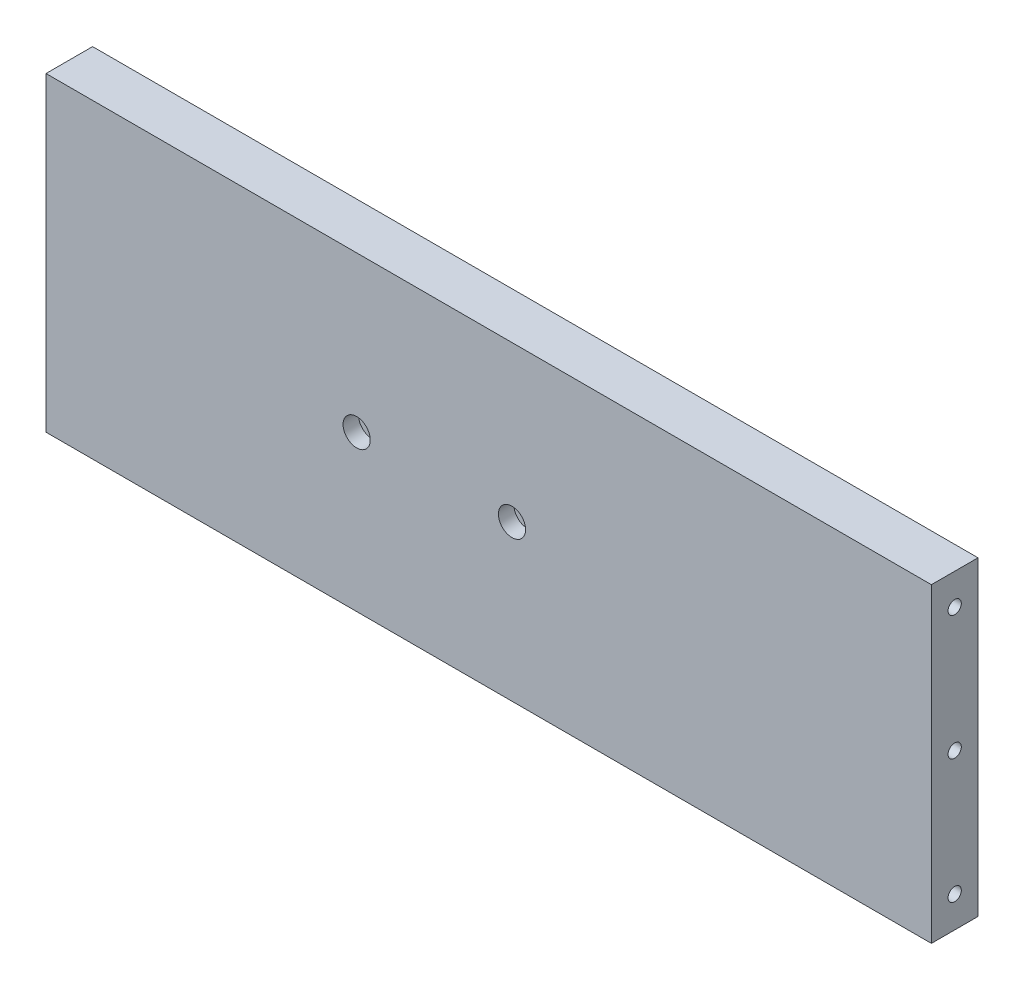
ISO-10303-21;
HEADER;
FILE_DESCRIPTION(('STEP AP214'),'2;1');
FILE_NAME('part.step','',(''),(''),'','','');
FILE_SCHEMA(('AUTOMOTIVE_DESIGN { 1 0 10303 214 1 1 1 1 }'));
ENDSEC;
DATA;
#1=APPLICATION_CONTEXT('core data for automotive mechanical design processes');
#2=APPLICATION_PROTOCOL_DEFINITION('international standard','automotive_design',2000,#1);
#3=PRODUCT_CONTEXT('',#1,'mechanical');
#4=PRODUCT('Part','Part','',(#3));
#5=PRODUCT_RELATED_PRODUCT_CATEGORY('part','',(#4));
#6=PRODUCT_DEFINITION_FORMATION('','',#4);
#7=PRODUCT_DEFINITION_CONTEXT('part definition',#1,'design');
#8=PRODUCT_DEFINITION('design','',#6,#7);
#9=PRODUCT_DEFINITION_SHAPE('','',#8);
#10=(LENGTH_UNIT() NAMED_UNIT(*) SI_UNIT(.MILLI.,.METRE.));
#11=(NAMED_UNIT(*) PLANE_ANGLE_UNIT() SI_UNIT($,.RADIAN.));
#12=(NAMED_UNIT(*) SI_UNIT($,.STERADIAN.) SOLID_ANGLE_UNIT());
#13=UNCERTAINTY_MEASURE_WITH_UNIT(LENGTH_MEASURE(1.E-05),#10,'distance_accuracy_value','');
#14=(GEOMETRIC_REPRESENTATION_CONTEXT(3) GLOBAL_UNCERTAINTY_ASSIGNED_CONTEXT((#13)) GLOBAL_UNIT_ASSIGNED_CONTEXT((#10,
#11,#12)) REPRESENTATION_CONTEXT('',''));
#15=CARTESIAN_POINT('',(0.,0.,0.));
#16=DIRECTION('',(0.,0.,1.));
#17=DIRECTION('',(1.,0.,0.));
#18=AXIS2_PLACEMENT_3D('',#15,#16,#17);
#19=CARTESIAN_POINT('',(-180.975,63.5,19.05));
#20=DIRECTION('',(1.,0.,0.));
#21=DIRECTION('',(0.,0.,-1.));
#22=AXIS2_PLACEMENT_3D('',#19,#20,#21);
#23=PLANE('',#22);
#24=CARTESIAN_POINT('',(-180.975,50.8,9.525));
#25=DIRECTION('',(-1.,0.,0.));
#26=DIRECTION('',(0.,0.,1.));
#27=AXIS2_PLACEMENT_3D('',#24,#25,#26);
#28=CIRCLE('',#27,2.70509999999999);
#29=CARTESIAN_POINT('',(-180.975,50.8,12.2301));
#30=VERTEX_POINT('',#29);
#31=EDGE_CURVE('E114',#30,#30,#28,.T.);
#32=ORIENTED_EDGE('',*,*,#31,.F.);
#33=EDGE_LOOP('',(#32));
#34=FACE_BOUND('',#33,.T.);
#35=CARTESIAN_POINT('',(-180.975,0.,9.525));
#36=DIRECTION('',(-1.,0.,0.));
#37=DIRECTION('',(0.,0.,1.));
#38=AXIS2_PLACEMENT_3D('',#35,#36,#37);
#39=CIRCLE('',#38,2.7051);
#40=CARTESIAN_POINT('',(-180.975,0.,12.2301));
#41=VERTEX_POINT('',#40);
#42=EDGE_CURVE('E113',#41,#41,#39,.T.);
#43=ORIENTED_EDGE('',*,*,#42,.F.);
#44=EDGE_LOOP('',(#43));
#45=FACE_BOUND('',#44,.T.);
#46=CARTESIAN_POINT('',(-180.975,-50.8,9.525));
#47=DIRECTION('',(-1.,0.,0.));
#48=DIRECTION('',(0.,0.,1.));
#49=AXIS2_PLACEMENT_3D('',#46,#47,#48);
#50=CIRCLE('',#49,2.70509999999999);
#51=CARTESIAN_POINT('',(-180.975,-50.8,12.2301));
#52=VERTEX_POINT('',#51);
#53=EDGE_CURVE('E126',#52,#52,#50,.T.);
#54=ORIENTED_EDGE('',*,*,#53,.F.);
#55=EDGE_LOOP('',(#54));
#56=FACE_BOUND('',#55,.T.);
#57=DIRECTION('',(0.,-1.,0.));
#58=VECTOR('',#57,1.);
#59=CARTESIAN_POINT('',(-180.975,63.5,0.));
#60=LINE('',#59,#58);
#61=CARTESIAN_POINT('',(-180.975,63.5,0.));
#62=VERTEX_POINT('',#61);
#63=CARTESIAN_POINT('',(-180.975,-63.5,0.));
#64=VERTEX_POINT('',#63);
#65=EDGE_CURVE('E150',#62,#64,#60,.T.);
#66=ORIENTED_EDGE('',*,*,#65,.T.);
#67=DIRECTION('',(0.,0.,-1.));
#68=VECTOR('',#67,1.);
#69=CARTESIAN_POINT('',(-180.975,-63.5,19.05));
#70=LINE('',#69,#68);
#71=CARTESIAN_POINT('',(-180.975,-63.5,19.05));
#72=VERTEX_POINT('',#71);
#73=EDGE_CURVE('E11',#72,#64,#70,.T.);
#74=ORIENTED_EDGE('',*,*,#73,.F.);
#75=DIRECTION('',(0.,-1.,0.));
#76=VECTOR('',#75,1.);
#77=CARTESIAN_POINT('',(-180.975,63.5,19.05));
#78=LINE('',#77,#76);
#79=CARTESIAN_POINT('',(-180.975,63.5,19.05));
#80=VERTEX_POINT('',#79);
#81=EDGE_CURVE('E151',#80,#72,#78,.T.);
#82=ORIENTED_EDGE('',*,*,#81,.F.);
#83=DIRECTION('',(0.,0.,-1.));
#84=VECTOR('',#83,1.);
#85=CARTESIAN_POINT('',(-180.975,63.5,19.05));
#86=LINE('',#85,#84);
#87=EDGE_CURVE('E157',#80,#62,#86,.T.);
#88=ORIENTED_EDGE('',*,*,#87,.T.);
#89=EDGE_LOOP('',(#66,#74,#82,#88));
#90=FACE_BOUND('',#89,.T.);
#91=ADVANCED_FACE('F37',(#34,#45,#56,#90),#23,.F.);
#92=CARTESIAN_POINT('',(-180.975,-63.5,19.05));
#93=DIRECTION('',(0.,1.,0.));
#94=DIRECTION('',(0.,0.,1.));
#95=AXIS2_PLACEMENT_3D('',#92,#93,#94);
#96=PLANE('',#95);
#97=DIRECTION('',(1.,0.,0.));
#98=VECTOR('',#97,1.);
#99=CARTESIAN_POINT('',(-180.975,-63.5,0.));
#100=LINE('',#99,#98);
#101=CARTESIAN_POINT('',(180.975,-63.5,0.));
#102=VERTEX_POINT('',#101);
#103=EDGE_CURVE('E160',#64,#102,#100,.T.);
#104=ORIENTED_EDGE('',*,*,#103,.T.);
#105=DIRECTION('',(0.,0.,-1.));
#106=VECTOR('',#105,1.);
#107=CARTESIAN_POINT('',(180.975,-63.5,19.05));
#108=LINE('',#107,#106);
#109=CARTESIAN_POINT('',(180.975,-63.5,19.05));
#110=VERTEX_POINT('',#109);
#111=EDGE_CURVE('E45',#110,#102,#108,.T.);
#112=ORIENTED_EDGE('',*,*,#111,.F.);
#113=DIRECTION('',(1.,0.,0.));
#114=VECTOR('',#113,1.);
#115=CARTESIAN_POINT('',(-180.975,-63.5,19.05));
#116=LINE('',#115,#114);
#117=EDGE_CURVE('E84',#72,#110,#116,.T.);
#118=ORIENTED_EDGE('',*,*,#117,.F.);
#119=ORIENTED_EDGE('',*,*,#73,.T.);
#120=EDGE_LOOP('',(#104,#112,#118,#119));
#121=FACE_BOUND('',#120,.T.);
#122=ADVANCED_FACE('F186',(#121),#96,.F.);
#123=CARTESIAN_POINT('',(180.975,63.5,19.05));
#124=DIRECTION('',(-1.,0.,0.));
#125=DIRECTION('',(0.,0.,1.));
#126=AXIS2_PLACEMENT_3D('',#123,#124,#125);
#127=PLANE('',#126);
#128=CARTESIAN_POINT('',(180.975,50.8,9.525));
#129=DIRECTION('',(1.,0.,0.));
#130=DIRECTION('',(0.,0.,-1.));
#131=AXIS2_PLACEMENT_3D('',#128,#129,#130);
#132=CIRCLE('',#131,2.70509999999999);
#133=CARTESIAN_POINT('',(180.975,50.8,6.81990000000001));
#134=VERTEX_POINT('',#133);
#135=EDGE_CURVE('E132',#134,#134,#132,.T.);
#136=ORIENTED_EDGE('',*,*,#135,.F.);
#137=EDGE_LOOP('',(#136));
#138=FACE_BOUND('',#137,.T.);
#139=CARTESIAN_POINT('',(180.975,0.,9.525));
#140=DIRECTION('',(1.,0.,0.));
#141=DIRECTION('',(0.,0.,-1.));
#142=AXIS2_PLACEMENT_3D('',#139,#140,#141);
#143=CIRCLE('',#142,2.7051);
#144=CARTESIAN_POINT('',(180.975,0.,6.8199));
#145=VERTEX_POINT('',#144);
#146=EDGE_CURVE('E138',#145,#145,#143,.T.);
#147=ORIENTED_EDGE('',*,*,#146,.F.);
#148=EDGE_LOOP('',(#147));
#149=FACE_BOUND('',#148,.T.);
#150=CARTESIAN_POINT('',(180.975,-50.8,9.525));
#151=DIRECTION('',(1.,0.,0.));
#152=DIRECTION('',(0.,0.,-1.));
#153=AXIS2_PLACEMENT_3D('',#150,#151,#152);
#154=CIRCLE('',#153,2.70509999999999);
#155=CARTESIAN_POINT('',(180.975,-50.8,6.81990000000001));
#156=VERTEX_POINT('',#155);
#157=EDGE_CURVE('E144',#156,#156,#154,.T.);
#158=ORIENTED_EDGE('',*,*,#157,.F.);
#159=EDGE_LOOP('',(#158));
#160=FACE_BOUND('',#159,.T.);
#161=DIRECTION('',(0.,1.,0.));
#162=VECTOR('',#161,1.);
#163=CARTESIAN_POINT('',(180.975,63.5,0.));
#164=LINE('',#163,#162);
#165=CARTESIAN_POINT('',(180.975,63.5,0.));
#166=VERTEX_POINT('',#165);
#167=EDGE_CURVE('E71',#102,#166,#164,.T.);
#168=ORIENTED_EDGE('',*,*,#167,.T.);
#169=DIRECTION('',(0.,0.,-1.));
#170=VECTOR('',#169,1.);
#171=CARTESIAN_POINT('',(180.975,63.5,19.05));
#172=LINE('',#171,#170);
#173=CARTESIAN_POINT('',(180.975,63.5,19.05));
#174=VERTEX_POINT('',#173);
#175=EDGE_CURVE('E165',#174,#166,#172,.T.);
#176=ORIENTED_EDGE('',*,*,#175,.F.);
#177=DIRECTION('',(0.,1.,0.));
#178=VECTOR('',#177,1.);
#179=CARTESIAN_POINT('',(180.975,63.5,19.05));
#180=LINE('',#179,#178);
#181=EDGE_CURVE('E154',#110,#174,#180,.T.);
#182=ORIENTED_EDGE('',*,*,#181,.F.);
#183=ORIENTED_EDGE('',*,*,#111,.T.);
#184=EDGE_LOOP('',(#168,#176,#182,#183));
#185=FACE_BOUND('',#184,.T.);
#186=ADVANCED_FACE('F167',(#138,#149,#160,#185),#127,.F.);
#187=CARTESIAN_POINT('',(-180.975,63.5,19.05));
#188=DIRECTION('',(0.,-1.,0.));
#189=DIRECTION('',(0.,0.,-1.));
#190=AXIS2_PLACEMENT_3D('',#187,#188,#189);
#191=PLANE('',#190);
#192=DIRECTION('',(-1.,0.,0.));
#193=VECTOR('',#192,1.);
#194=CARTESIAN_POINT('',(-180.975,63.5,0.));
#195=LINE('',#194,#193);
#196=EDGE_CURVE('E77',#166,#62,#195,.T.);
#197=ORIENTED_EDGE('',*,*,#196,.T.);
#198=ORIENTED_EDGE('',*,*,#87,.F.);
#199=DIRECTION('',(-1.,0.,0.));
#200=VECTOR('',#199,1.);
#201=CARTESIAN_POINT('',(-180.975,63.5,19.05));
#202=LINE('',#201,#200);
#203=EDGE_CURVE('E53',#174,#80,#202,.T.);
#204=ORIENTED_EDGE('',*,*,#203,.F.);
#205=ORIENTED_EDGE('',*,*,#175,.T.);
#206=EDGE_LOOP('',(#197,#198,#204,#205));
#207=FACE_BOUND('',#206,.T.);
#208=ADVANCED_FACE('F174',(#207),#191,.F.);
#209=CARTESIAN_POINT('',(0.,0.,19.05));
#210=DIRECTION('',(0.,0.,1.));
#211=DIRECTION('',(1.,0.,0.));
#212=AXIS2_PLACEMENT_3D('',#209,#210,#211);
#213=PLANE('',#212);
#214=CARTESIAN_POINT('',(-53.975,0.,19.05));
#215=DIRECTION('',(0.,0.,1.));
#216=DIRECTION('',(1.,0.,0.));
#217=AXIS2_PLACEMENT_3D('',#214,#215,#216);
#218=CIRCLE('',#217,5.55625);
#219=CARTESIAN_POINT('',(-48.41875,0.,19.05));
#220=VERTEX_POINT('',#219);
#221=EDGE_CURVE('E272',#220,#220,#218,.T.);
#222=ORIENTED_EDGE('',*,*,#221,.F.);
#223=EDGE_LOOP('',(#222));
#224=FACE_BOUND('',#223,.T.);
#225=CARTESIAN_POINT('',(9.52499999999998,0.,19.05));
#226=DIRECTION('',(0.,0.,1.));
#227=DIRECTION('',(1.,0.,0.));
#228=AXIS2_PLACEMENT_3D('',#225,#226,#227);
#229=CIRCLE('',#228,5.55625);
#230=CARTESIAN_POINT('',(15.08125,0.,19.05));
#231=VERTEX_POINT('',#230);
#232=EDGE_CURVE('E262',#231,#231,#229,.T.);
#233=ORIENTED_EDGE('',*,*,#232,.F.);
#234=EDGE_LOOP('',(#233));
#235=FACE_BOUND('',#234,.T.);
#236=ORIENTED_EDGE('',*,*,#81,.T.);
#237=ORIENTED_EDGE('',*,*,#117,.T.);
#238=ORIENTED_EDGE('',*,*,#181,.T.);
#239=ORIENTED_EDGE('',*,*,#203,.T.);
#240=EDGE_LOOP('',(#236,#237,#238,#239));
#241=FACE_BOUND('',#240,.T.);
#242=ADVANCED_FACE('F176',(#224,#235,#241),#213,.T.);
#243=CARTESIAN_POINT('',(0.,0.,0.));
#244=DIRECTION('',(0.,0.,1.));
#245=DIRECTION('',(1.,0.,0.));
#246=AXIS2_PLACEMENT_3D('',#243,#244,#245);
#247=PLANE('',#246);
#248=CARTESIAN_POINT('',(-53.975,0.,0.));
#249=DIRECTION('',(0.,0.,1.));
#250=DIRECTION('',(1.,0.,0.));
#251=AXIS2_PLACEMENT_3D('',#248,#249,#250);
#252=CIRCLE('',#251,3.26389999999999);
#253=CARTESIAN_POINT('',(-50.7111,0.,0.));
#254=VERTEX_POINT('',#253);
#255=EDGE_CURVE('E251',#254,#254,#252,.T.);
#256=ORIENTED_EDGE('',*,*,#255,.T.);
#257=EDGE_LOOP('',(#256));
#258=FACE_BOUND('',#257,.T.);
#259=CARTESIAN_POINT('',(9.52499999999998,0.,0.));
#260=DIRECTION('',(0.,0.,1.));
#261=DIRECTION('',(1.,0.,0.));
#262=AXIS2_PLACEMENT_3D('',#259,#260,#261);
#263=CIRCLE('',#262,3.2639);
#264=CARTESIAN_POINT('',(12.7889,0.,0.));
#265=VERTEX_POINT('',#264);
#266=EDGE_CURVE('E120',#265,#265,#263,.T.);
#267=ORIENTED_EDGE('',*,*,#266,.T.);
#268=EDGE_LOOP('',(#267));
#269=FACE_BOUND('',#268,.T.);
#270=ORIENTED_EDGE('',*,*,#65,.F.);
#271=ORIENTED_EDGE('',*,*,#196,.F.);
#272=ORIENTED_EDGE('',*,*,#167,.F.);
#273=ORIENTED_EDGE('',*,*,#103,.F.);
#274=EDGE_LOOP('',(#270,#271,#272,#273));
#275=FACE_BOUND('',#274,.T.);
#276=ADVANCED_FACE('F170',(#258,#269,#275),#247,.F.);
#277=CARTESIAN_POINT('',(165.5572,-50.8,9.525));
#278=DIRECTION('',(1.,0.,0.));
#279=DIRECTION('',(0.,0.,-1.));
#280=AXIS2_PLACEMENT_3D('',#277,#278,#279);
#281=CONICAL_SURFACE('',#280,2.70509999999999,1.02974425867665);
#282=CARTESIAN_POINT('',(163.931811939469,-50.8,9.525));
#283=VERTEX_POINT('',#282);
#284=VERTEX_LOOP('',#283);
#285=FACE_BOUND('',#284,.T.);
#286=CARTESIAN_POINT('',(165.5572,-50.8,9.525));
#287=DIRECTION('',(1.,0.,0.));
#288=DIRECTION('',(0.,0.,-1.));
#289=AXIS2_PLACEMENT_3D('',#286,#287,#288);
#290=CIRCLE('',#289,2.70509999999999);
#291=CARTESIAN_POINT('',(165.5572,-50.8,6.81990000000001));
#292=VERTEX_POINT('',#291);
#293=EDGE_CURVE('E147',#292,#292,#290,.T.);
#294=ORIENTED_EDGE('',*,*,#293,.T.);
#295=EDGE_LOOP('',(#294));
#296=FACE_BOUND('',#295,.T.);
#297=ADVANCED_FACE('F239',(#285,#296),#281,.F.);
#298=CARTESIAN_POINT('',(180.975,-50.8,9.525));
#299=DIRECTION('',(1.,0.,0.));
#300=DIRECTION('',(0.,0.,-1.));
#301=AXIS2_PLACEMENT_3D('',#298,#299,#300);
#302=CYLINDRICAL_SURFACE('',#301,2.70509999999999);
#303=ORIENTED_EDGE('',*,*,#293,.F.);
#304=EDGE_LOOP('',(#303));
#305=FACE_BOUND('',#304,.T.);
#306=ORIENTED_EDGE('',*,*,#157,.T.);
#307=EDGE_LOOP('',(#306));
#308=FACE_BOUND('',#307,.T.);
#309=ADVANCED_FACE('F235',(#305,#308),#302,.F.);
#310=CARTESIAN_POINT('',(165.5572,0.,9.525));
#311=DIRECTION('',(1.,0.,0.));
#312=DIRECTION('',(0.,0.,-1.));
#313=AXIS2_PLACEMENT_3D('',#310,#311,#312);
#314=CONICAL_SURFACE('',#313,2.70509999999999,1.02974425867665);
#315=CARTESIAN_POINT('',(163.931811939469,0.,9.525));
#316=VERTEX_POINT('',#315);
#317=VERTEX_LOOP('',#316);
#318=FACE_BOUND('',#317,.T.);
#319=CARTESIAN_POINT('',(165.5572,0.,9.525));
#320=DIRECTION('',(1.,0.,0.));
#321=DIRECTION('',(0.,0.,-1.));
#322=AXIS2_PLACEMENT_3D('',#319,#320,#321);
#323=CIRCLE('',#322,2.70509999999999);
#324=CARTESIAN_POINT('',(165.5572,0.,6.81990000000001));
#325=VERTEX_POINT('',#324);
#326=EDGE_CURVE('E141',#325,#325,#323,.T.);
#327=ORIENTED_EDGE('',*,*,#326,.T.);
#328=EDGE_LOOP('',(#327));
#329=FACE_BOUND('',#328,.T.);
#330=ADVANCED_FACE('F231',(#318,#329),#314,.F.);
#331=CARTESIAN_POINT('',(180.975,0.,9.525));
#332=DIRECTION('',(1.,0.,0.));
#333=DIRECTION('',(0.,0.,-1.));
#334=AXIS2_PLACEMENT_3D('',#331,#332,#333);
#335=CYLINDRICAL_SURFACE('',#334,2.7051);
#336=ORIENTED_EDGE('',*,*,#326,.F.);
#337=EDGE_LOOP('',(#336));
#338=FACE_BOUND('',#337,.T.);
#339=ORIENTED_EDGE('',*,*,#146,.T.);
#340=EDGE_LOOP('',(#339));
#341=FACE_BOUND('',#340,.T.);
#342=ADVANCED_FACE('F227',(#338,#341),#335,.F.);
#343=CARTESIAN_POINT('',(165.5572,50.8,9.525));
#344=DIRECTION('',(1.,0.,0.));
#345=DIRECTION('',(0.,0.,-1.));
#346=AXIS2_PLACEMENT_3D('',#343,#344,#345);
#347=CONICAL_SURFACE('',#346,2.70509999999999,1.02974425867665);
#348=CARTESIAN_POINT('',(163.931811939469,50.8,9.525));
#349=VERTEX_POINT('',#348);
#350=VERTEX_LOOP('',#349);
#351=FACE_BOUND('',#350,.T.);
#352=CARTESIAN_POINT('',(165.5572,50.8,9.525));
#353=DIRECTION('',(1.,0.,0.));
#354=DIRECTION('',(0.,0.,-1.));
#355=AXIS2_PLACEMENT_3D('',#352,#353,#354);
#356=CIRCLE('',#355,2.70509999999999);
#357=CARTESIAN_POINT('',(165.5572,50.8,6.81990000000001));
#358=VERTEX_POINT('',#357);
#359=EDGE_CURVE('E135',#358,#358,#356,.T.);
#360=ORIENTED_EDGE('',*,*,#359,.T.);
#361=EDGE_LOOP('',(#360));
#362=FACE_BOUND('',#361,.T.);
#363=ADVANCED_FACE('F223',(#351,#362),#347,.F.);
#364=CARTESIAN_POINT('',(180.975,50.8,9.525));
#365=DIRECTION('',(1.,0.,0.));
#366=DIRECTION('',(0.,0.,-1.));
#367=AXIS2_PLACEMENT_3D('',#364,#365,#366);
#368=CYLINDRICAL_SURFACE('',#367,2.70509999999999);
#369=ORIENTED_EDGE('',*,*,#359,.F.);
#370=EDGE_LOOP('',(#369));
#371=FACE_BOUND('',#370,.T.);
#372=ORIENTED_EDGE('',*,*,#135,.T.);
#373=EDGE_LOOP('',(#372));
#374=FACE_BOUND('',#373,.T.);
#375=ADVANCED_FACE('F215',(#371,#374),#368,.F.);
#376=CARTESIAN_POINT('',(-165.5572,-50.8,9.525));
#377=DIRECTION('',(-1.,0.,0.));
#378=DIRECTION('',(0.,0.,1.));
#379=AXIS2_PLACEMENT_3D('',#376,#377,#378);
#380=CONICAL_SURFACE('',#379,2.70509999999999,1.02974425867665);
#381=CARTESIAN_POINT('',(-163.931811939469,-50.8,9.525));
#382=VERTEX_POINT('',#381);
#383=VERTEX_LOOP('',#382);
#384=FACE_BOUND('',#383,.T.);
#385=CARTESIAN_POINT('',(-165.5572,-50.8,9.525));
#386=DIRECTION('',(-1.,0.,0.));
#387=DIRECTION('',(0.,0.,1.));
#388=AXIS2_PLACEMENT_3D('',#385,#386,#387);
#389=CIRCLE('',#388,2.70509999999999);
#390=CARTESIAN_POINT('',(-165.5572,-50.8,12.2301));
#391=VERTEX_POINT('',#390);
#392=EDGE_CURVE('E129',#391,#391,#389,.T.);
#393=ORIENTED_EDGE('',*,*,#392,.T.);
#394=EDGE_LOOP('',(#393));
#395=FACE_BOUND('',#394,.T.);
#396=ADVANCED_FACE('F206',(#384,#395),#380,.F.);
#397=CARTESIAN_POINT('',(-180.975,-50.8,9.525));
#398=DIRECTION('',(-1.,0.,0.));
#399=DIRECTION('',(0.,0.,1.));
#400=AXIS2_PLACEMENT_3D('',#397,#398,#399);
#401=CYLINDRICAL_SURFACE('',#400,2.70509999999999);
#402=ORIENTED_EDGE('',*,*,#392,.F.);
#403=EDGE_LOOP('',(#402));
#404=FACE_BOUND('',#403,.T.);
#405=ORIENTED_EDGE('',*,*,#53,.T.);
#406=EDGE_LOOP('',(#405));
#407=FACE_BOUND('',#406,.T.);
#408=ADVANCED_FACE('F203',(#404,#407),#401,.F.);
#409=CARTESIAN_POINT('',(-165.5572,0.,9.525));
#410=DIRECTION('',(-1.,0.,0.));
#411=DIRECTION('',(0.,0.,1.));
#412=AXIS2_PLACEMENT_3D('',#409,#410,#411);
#413=CONICAL_SURFACE('',#412,2.70509999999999,1.02974425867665);
#414=CARTESIAN_POINT('',(-163.931811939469,0.,9.525));
#415=VERTEX_POINT('',#414);
#416=VERTEX_LOOP('',#415);
#417=FACE_BOUND('',#416,.T.);
#418=CARTESIAN_POINT('',(-165.5572,0.,9.525));
#419=DIRECTION('',(-1.,0.,0.));
#420=DIRECTION('',(0.,0.,1.));
#421=AXIS2_PLACEMENT_3D('',#418,#419,#420);
#422=CIRCLE('',#421,2.70509999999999);
#423=CARTESIAN_POINT('',(-165.5572,0.,12.2301));
#424=VERTEX_POINT('',#423);
#425=EDGE_CURVE('E117',#424,#424,#422,.T.);
#426=ORIENTED_EDGE('',*,*,#425,.T.);
#427=EDGE_LOOP('',(#426));
#428=FACE_BOUND('',#427,.T.);
#429=ADVANCED_FACE('F205',(#417,#428),#413,.F.);
#430=CARTESIAN_POINT('',(-180.975,0.,9.525));
#431=DIRECTION('',(-1.,0.,0.));
#432=DIRECTION('',(0.,0.,1.));
#433=AXIS2_PLACEMENT_3D('',#430,#431,#432);
#434=CYLINDRICAL_SURFACE('',#433,2.7051);
#435=ORIENTED_EDGE('',*,*,#425,.F.);
#436=EDGE_LOOP('',(#435));
#437=FACE_BOUND('',#436,.T.);
#438=ORIENTED_EDGE('',*,*,#42,.T.);
#439=EDGE_LOOP('',(#438));
#440=FACE_BOUND('',#439,.T.);
#441=ADVANCED_FACE('F107',(#437,#440),#434,.F.);
#442=CARTESIAN_POINT('',(-165.5572,50.8,9.525));
#443=DIRECTION('',(-1.,0.,0.));
#444=DIRECTION('',(0.,0.,1.));
#445=AXIS2_PLACEMENT_3D('',#442,#443,#444);
#446=CONICAL_SURFACE('',#445,2.70509999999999,1.02974425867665);
#447=CARTESIAN_POINT('',(-163.931811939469,50.8,9.525));
#448=VERTEX_POINT('',#447);
#449=VERTEX_LOOP('',#448);
#450=FACE_BOUND('',#449,.T.);
#451=CARTESIAN_POINT('',(-165.5572,50.8,9.525));
#452=DIRECTION('',(-1.,0.,0.));
#453=DIRECTION('',(0.,0.,1.));
#454=AXIS2_PLACEMENT_3D('',#451,#452,#453);
#455=CIRCLE('',#454,2.70509999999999);
#456=CARTESIAN_POINT('',(-165.5572,50.8,12.2301));
#457=VERTEX_POINT('',#456);
#458=EDGE_CURVE('E111',#457,#457,#455,.T.);
#459=ORIENTED_EDGE('',*,*,#458,.T.);
#460=EDGE_LOOP('',(#459));
#461=FACE_BOUND('',#460,.T.);
#462=ADVANCED_FACE('F103',(#450,#461),#446,.F.);
#463=CARTESIAN_POINT('',(-180.975,50.8,9.525));
#464=DIRECTION('',(-1.,0.,0.));
#465=DIRECTION('',(0.,0.,1.));
#466=AXIS2_PLACEMENT_3D('',#463,#464,#465);
#467=CYLINDRICAL_SURFACE('',#466,2.70509999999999);
#468=ORIENTED_EDGE('',*,*,#458,.F.);
#469=EDGE_LOOP('',(#468));
#470=FACE_BOUND('',#469,.T.);
#471=ORIENTED_EDGE('',*,*,#31,.T.);
#472=EDGE_LOOP('',(#471));
#473=FACE_BOUND('',#472,.T.);
#474=ADVANCED_FACE('F106',(#470,#473),#467,.F.);
#475=CARTESIAN_POINT('',(9.52499999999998,0.,19.05));
#476=DIRECTION('',(0.,0.,1.));
#477=DIRECTION('',(1.,0.,0.));
#478=AXIS2_PLACEMENT_3D('',#475,#476,#477);
#479=CYLINDRICAL_SURFACE('',#478,3.2639);
#480=ORIENTED_EDGE('',*,*,#266,.F.);
#481=EDGE_LOOP('',(#480));
#482=FACE_BOUND('',#481,.T.);
#483=CARTESIAN_POINT('',(9.52499999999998,0.,12.7));
#484=DIRECTION('',(0.,0.,1.));
#485=DIRECTION('',(1.,0.,0.));
#486=AXIS2_PLACEMENT_3D('',#483,#484,#485);
#487=CIRCLE('',#486,3.26390000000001);
#488=CARTESIAN_POINT('',(12.7889,0.,12.7));
#489=VERTEX_POINT('',#488);
#490=EDGE_CURVE('E255',#489,#489,#487,.T.);
#491=ORIENTED_EDGE('',*,*,#490,.T.);
#492=EDGE_LOOP('',(#491));
#493=FACE_BOUND('',#492,.T.);
#494=ADVANCED_FACE('F293',(#482,#493),#479,.F.);
#495=CARTESIAN_POINT('',(12.7889,0.,12.7));
#496=DIRECTION('',(0.,0.,-1.));
#497=DIRECTION('',(-1.,0.,0.));
#498=AXIS2_PLACEMENT_3D('',#495,#496,#497);
#499=PLANE('',#498);
#500=ORIENTED_EDGE('',*,*,#490,.F.);
#501=EDGE_LOOP('',(#500));
#502=FACE_BOUND('',#501,.T.);
#503=CARTESIAN_POINT('',(9.52499999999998,0.,12.7));
#504=DIRECTION('',(0.,0.,1.));
#505=DIRECTION('',(1.,0.,0.));
#506=AXIS2_PLACEMENT_3D('',#503,#504,#505);
#507=CIRCLE('',#506,5.55625);
#508=CARTESIAN_POINT('',(15.08125,0.,12.7));
#509=VERTEX_POINT('',#508);
#510=EDGE_CURVE('E257',#509,#509,#507,.T.);
#511=ORIENTED_EDGE('',*,*,#510,.T.);
#512=EDGE_LOOP('',(#511));
#513=FACE_BOUND('',#512,.T.);
#514=ADVANCED_FACE('F283',(#502,#513),#499,.F.);
#515=CARTESIAN_POINT('',(9.52499999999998,0.,19.05));
#516=DIRECTION('',(0.,0.,1.));
#517=DIRECTION('',(1.,0.,0.));
#518=AXIS2_PLACEMENT_3D('',#515,#516,#517);
#519=CYLINDRICAL_SURFACE('',#518,5.55625);
#520=ORIENTED_EDGE('',*,*,#510,.F.);
#521=EDGE_LOOP('',(#520));
#522=FACE_BOUND('',#521,.T.);
#523=ORIENTED_EDGE('',*,*,#232,.T.);
#524=EDGE_LOOP('',(#523));
#525=FACE_BOUND('',#524,.T.);
#526=ADVANCED_FACE('F280',(#522,#525),#519,.F.);
#527=CARTESIAN_POINT('',(-53.975,0.,19.05));
#528=DIRECTION('',(0.,0.,1.));
#529=DIRECTION('',(1.,0.,0.));
#530=AXIS2_PLACEMENT_3D('',#527,#528,#529);
#531=CYLINDRICAL_SURFACE('',#530,3.2639);
#532=ORIENTED_EDGE('',*,*,#255,.F.);
#533=EDGE_LOOP('',(#532));
#534=FACE_BOUND('',#533,.T.);
#535=CARTESIAN_POINT('',(-53.975,0.,12.7));
#536=DIRECTION('',(0.,0.,1.));
#537=DIRECTION('',(1.,0.,0.));
#538=AXIS2_PLACEMENT_3D('',#535,#536,#537);
#539=CIRCLE('',#538,3.26390000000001);
#540=CARTESIAN_POINT('',(-50.7111,0.,12.7));
#541=VERTEX_POINT('',#540);
#542=EDGE_CURVE('E266',#541,#541,#539,.T.);
#543=ORIENTED_EDGE('',*,*,#542,.T.);
#544=EDGE_LOOP('',(#543));
#545=FACE_BOUND('',#544,.T.);
#546=ADVANCED_FACE('F282',(#534,#545),#531,.F.);
#547=CARTESIAN_POINT('',(-50.7111,0.,12.7));
#548=DIRECTION('',(0.,0.,-1.));
#549=DIRECTION('',(-1.,0.,0.));
#550=AXIS2_PLACEMENT_3D('',#547,#548,#549);
#551=PLANE('',#550);
#552=ORIENTED_EDGE('',*,*,#542,.F.);
#553=EDGE_LOOP('',(#552));
#554=FACE_BOUND('',#553,.T.);
#555=CARTESIAN_POINT('',(-53.975,0.,12.7));
#556=DIRECTION('',(0.,0.,1.));
#557=DIRECTION('',(1.,0.,0.));
#558=AXIS2_PLACEMENT_3D('',#555,#556,#557);
#559=CIRCLE('',#558,5.55625);
#560=CARTESIAN_POINT('',(-48.41875,0.,12.7));
#561=VERTEX_POINT('',#560);
#562=EDGE_CURVE('E269',#561,#561,#559,.T.);
#563=ORIENTED_EDGE('',*,*,#562,.T.);
#564=EDGE_LOOP('',(#563));
#565=FACE_BOUND('',#564,.T.);
#566=ADVANCED_FACE('F290',(#554,#565),#551,.F.);
#567=CARTESIAN_POINT('',(-53.975,0.,19.05));
#568=DIRECTION('',(0.,0.,1.));
#569=DIRECTION('',(1.,0.,0.));
#570=AXIS2_PLACEMENT_3D('',#567,#568,#569);
#571=CYLINDRICAL_SURFACE('',#570,5.55625);
#572=ORIENTED_EDGE('',*,*,#562,.F.);
#573=EDGE_LOOP('',(#572));
#574=FACE_BOUND('',#573,.T.);
#575=ORIENTED_EDGE('',*,*,#221,.T.);
#576=EDGE_LOOP('',(#575));
#577=FACE_BOUND('',#576,.T.);
#578=ADVANCED_FACE('F276',(#574,#577),#571,.F.);
#579=CLOSED_SHELL('',(#91,#122,#186,#208,#242,#276,#297,#309,#330,#342,#363,#375,#396,#408,#429,
#441,#462,#474,#494,#514,#526,#546,#566,#578));
#580=MANIFOLD_SOLID_BREP('B2',#579);
#581=ADVANCED_BREP_SHAPE_REPRESENTATION('',(#18,#580),#14);
#582=SHAPE_DEFINITION_REPRESENTATION(#9,#581);
ENDSEC;
END-ISO-10303-21;
